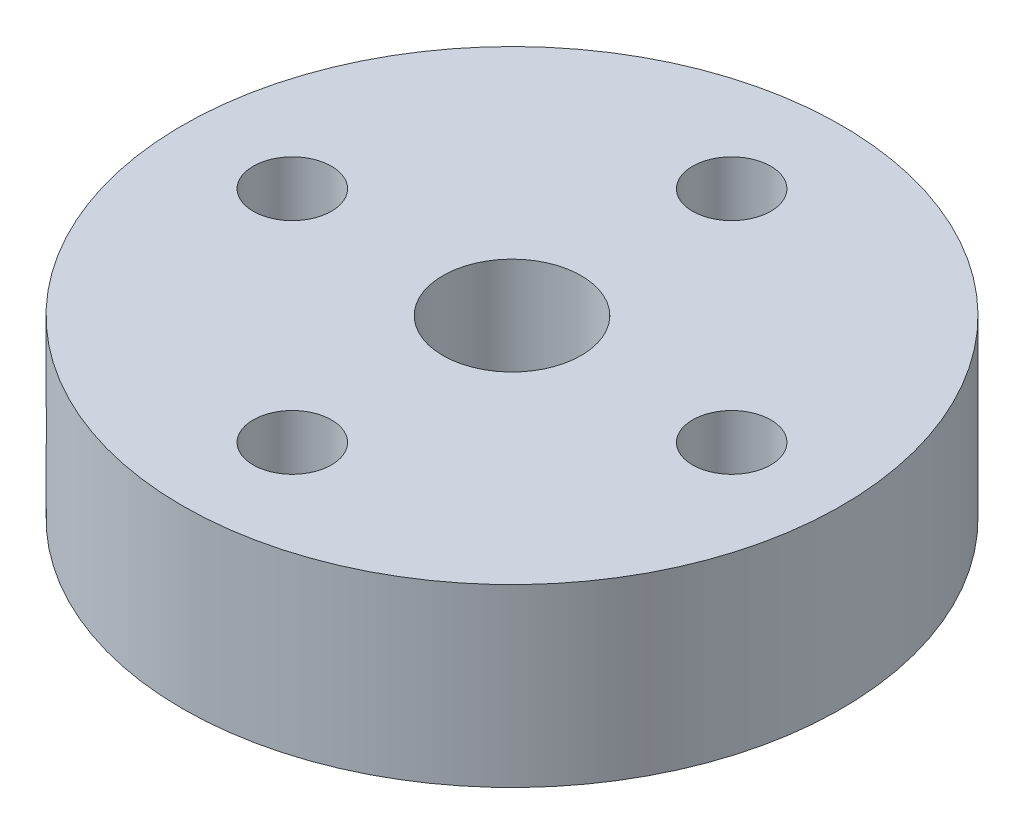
from build123d import *

# Parameters (mm, degrees)
ESQUISSE1_R              = 9.525
ESQUISSE1_R_2            = 2
BOSS_EXTRU_1_DEPTH       = 5.08
TROU_TARAUD_4_401_D      = 2.2606
TROU_TARAUD_4_402_REACH  = 25.119
TROU_TARAUD_4_402_BORE_R = 1.1303


with BuildPart() as part:
    # Esquisse1 → Boss.-Extru.1 (new body)
    with BuildSketch(Plane(origin=(0, 0, 0), x_dir=(1, 0, 0), z_dir=(0, 1, 0))):
        with Locations(Location((0, 0, 0), (0, 0, 270))):
            Circle(ESQUISSE1_R)
        with Locations(Location((0, 0, 0), (0, 0, 270))):
            Circle(ESQUISSE1_R_2, mode=Mode.SUBTRACT)
    extrude(amount=BOSS_EXTRU_1_DEPTH)

    # Trou taraud_ _4-401 (through all)
    with Locations(Plane(origin=(0, 5.08, 0), x_dir=(1, 0, 0), z_dir=(0, 1, 0))):
        with Locations((0, -6.35), (0, 6.35), (-6.35, 0), (6.35, 0)):
            Hole(TROU_TARAUD_4_401_D / 2)

    # Trou taraud_ _4-402 bore (on position points) → Trou taraud_ _4-402 (cut, up to next)
    with BuildSketch(Plane(origin=(-7.227796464, 2.54, 6.203594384), x_dir=(-0.651295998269, 0, -0.758823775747), z_dir=(-0.758823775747, 0, 0.651295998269)), mode=Mode.PRIVATE) as trou_taraud_4_402_sk1:
        Circle(TROU_TARAUD_4_402_BORE_R)
    trou_taraud_4_402_tool1 = extrude(trou_taraud_4_402_sk1.sketch, amount=-TROU_TARAUD_4_402_REACH, mode=Mode.PRIVATE) & part.part
    add(trou_taraud_4_402_tool1.solids().sort_by_distance((-7.227796, 2.54, 6.203594))[0], mode=Mode.SUBTRACT)


solid = part.part
